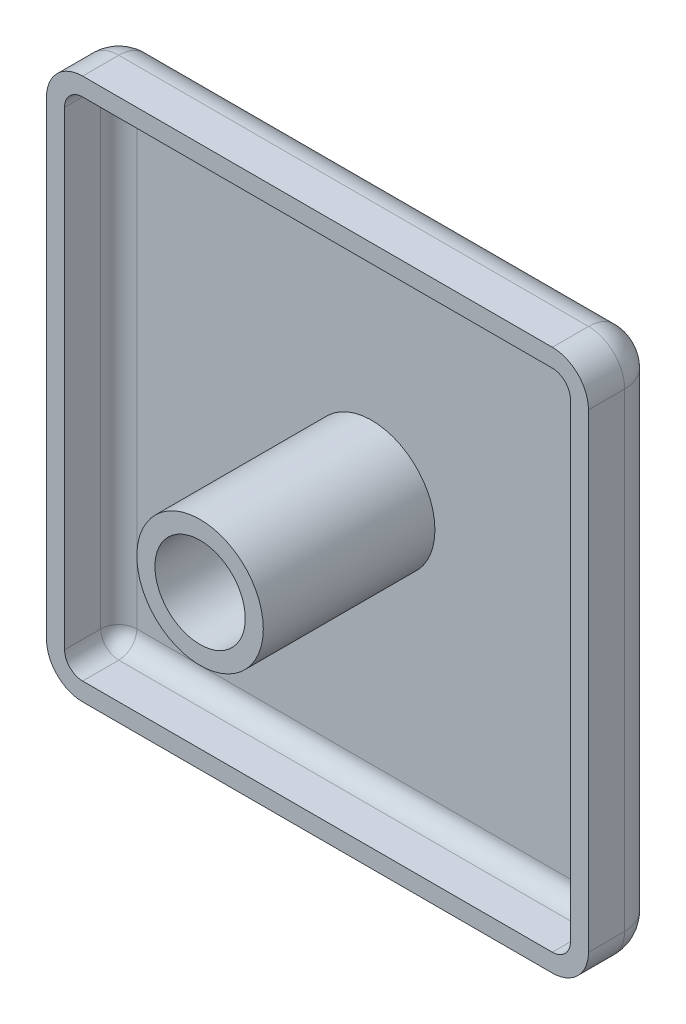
ISO-10303-21;
HEADER;
FILE_DESCRIPTION(('STEP AP214'),'2;1');
FILE_NAME('part.step','',(''),(''),'','','');
FILE_SCHEMA(('AUTOMOTIVE_DESIGN { 1 0 10303 214 1 1 1 1 }'));
ENDSEC;
DATA;
#1=APPLICATION_CONTEXT('core data for automotive mechanical design processes');
#2=APPLICATION_PROTOCOL_DEFINITION('international standard','automotive_design',2000,#1);
#3=PRODUCT_CONTEXT('',#1,'mechanical');
#4=PRODUCT('Part','Part','',(#3));
#5=PRODUCT_RELATED_PRODUCT_CATEGORY('part','',(#4));
#6=PRODUCT_DEFINITION_FORMATION('','',#4);
#7=PRODUCT_DEFINITION_CONTEXT('part definition',#1,'design');
#8=PRODUCT_DEFINITION('design','',#6,#7);
#9=PRODUCT_DEFINITION_SHAPE('','',#8);
#10=(LENGTH_UNIT() NAMED_UNIT(*) SI_UNIT(.MILLI.,.METRE.));
#11=(NAMED_UNIT(*) PLANE_ANGLE_UNIT() SI_UNIT($,.RADIAN.));
#12=(NAMED_UNIT(*) SI_UNIT($,.STERADIAN.) SOLID_ANGLE_UNIT());
#13=UNCERTAINTY_MEASURE_WITH_UNIT(LENGTH_MEASURE(1.E-05),#10,'distance_accuracy_value','');
#14=(GEOMETRIC_REPRESENTATION_CONTEXT(3) GLOBAL_UNCERTAINTY_ASSIGNED_CONTEXT((#13)) GLOBAL_UNIT_ASSIGNED_CONTEXT((#10,
#11,#12)) REPRESENTATION_CONTEXT('',''));
#15=CARTESIAN_POINT('',(0.,0.,0.));
#16=DIRECTION('',(0.,0.,1.));
#17=DIRECTION('',(1.,0.,0.));
#18=AXIS2_PLACEMENT_3D('',#15,#16,#17);
#19=CARTESIAN_POINT('',(0.,0.,-1.));
#20=DIRECTION('',(0.,0.,1.));
#21=DIRECTION('',(1.,0.,0.));
#22=AXIS2_PLACEMENT_3D('',#19,#20,#21);
#23=PLANE('',#22);
#24=DIRECTION('',(0.,1.,0.));
#25=VECTOR('',#24,1.);
#26=CARTESIAN_POINT('',(-13.,0.,-1.));
#27=LINE('',#26,#25);
#28=CARTESIAN_POINT('',(-13.,-13.,-1.));
#29=VERTEX_POINT('',#28);
#30=CARTESIAN_POINT('',(-13.,13.,-1.));
#31=VERTEX_POINT('',#30);
#32=EDGE_CURVE('E466',#29,#31,#27,.T.);
#33=ORIENTED_EDGE('',*,*,#32,.F.);
#34=DIRECTION('',(1.,0.,0.));
#35=VECTOR('',#34,1.);
#36=CARTESIAN_POINT('',(0.,-13.,-1.));
#37=LINE('',#36,#35);
#38=CARTESIAN_POINT('',(13.,-13.,-1.));
#39=VERTEX_POINT('',#38);
#40=EDGE_CURVE('E240',#39,#29,#37,.F.);
#41=ORIENTED_EDGE('',*,*,#40,.F.);
#42=DIRECTION('',(0.,1.,0.));
#43=VECTOR('',#42,1.);
#44=CARTESIAN_POINT('',(13.,0.,-1.));
#45=LINE('',#44,#43);
#46=CARTESIAN_POINT('',(13.,13.,-1.));
#47=VERTEX_POINT('',#46);
#48=EDGE_CURVE('E464',#47,#39,#45,.F.);
#49=ORIENTED_EDGE('',*,*,#48,.F.);
#50=DIRECTION('',(1.,0.,0.));
#51=VECTOR('',#50,1.);
#52=CARTESIAN_POINT('',(0.,13.,-1.));
#53=LINE('',#52,#51);
#54=EDGE_CURVE('E467',#31,#47,#53,.T.);
#55=ORIENTED_EDGE('',*,*,#54,.F.);
#56=EDGE_LOOP('',(#33,#41,#49,#55));
#57=FACE_BOUND('',#56,.T.);
#58=CARTESIAN_POINT('',(0.,0.,-1.));
#59=DIRECTION('',(0.,0.,1.));
#60=DIRECTION('',(1.,0.,0.));
#61=AXIS2_PLACEMENT_3D('',#58,#59,#60);
#62=CIRCLE('',#61,3.5);
#63=CARTESIAN_POINT('',(3.5,0.,-1.));
#64=VERTEX_POINT('',#63);
#65=EDGE_CURVE('E489',#64,#64,#62,.T.);
#66=ORIENTED_EDGE('',*,*,#65,.F.);
#67=EDGE_LOOP('',(#66));
#68=FACE_BOUND('',#67,.T.);
#69=ADVANCED_FACE('F33',(#57,#68),#23,.T.);
#70=CARTESIAN_POINT('',(-15.,15.,2.));
#71=DIRECTION('',(1.,0.,0.));
#72=DIRECTION('',(0.,1.,0.));
#73=AXIS2_PLACEMENT_3D('',#70,#71,#72);
#74=PLANE('',#73);
#75=DIRECTION('',(0.,-1.,0.));
#76=VECTOR('',#75,1.);
#77=CARTESIAN_POINT('',(-15.,15.,2.));
#78=LINE('',#77,#76);
#79=CARTESIAN_POINT('',(-15.,13.,2.));
#80=VERTEX_POINT('',#79);
#81=CARTESIAN_POINT('',(-15.,-13.,2.));
#82=VERTEX_POINT('',#81);
#83=EDGE_CURVE('E241',#80,#82,#78,.T.);
#84=ORIENTED_EDGE('',*,*,#83,.F.);
#85=DIRECTION('',(0.,0.,-1.));
#86=VECTOR('',#85,1.);
#87=CARTESIAN_POINT('',(-15.,13.,2.));
#88=LINE('',#87,#86);
#89=CARTESIAN_POINT('',(-15.,13.,0.));
#90=VERTEX_POINT('',#89);
#91=EDGE_CURVE('E258',#80,#90,#88,.T.);
#92=ORIENTED_EDGE('',*,*,#91,.T.);
#93=DIRECTION('',(0.,-1.,0.));
#94=VECTOR('',#93,1.);
#95=CARTESIAN_POINT('',(-15.,15.,0.));
#96=LINE('',#95,#94);
#97=CARTESIAN_POINT('',(-15.,-13.,0.));
#98=VERTEX_POINT('',#97);
#99=EDGE_CURVE('E256',#90,#98,#96,.T.);
#100=ORIENTED_EDGE('',*,*,#99,.T.);
#101=DIRECTION('',(0.,0.,-1.));
#102=VECTOR('',#101,1.);
#103=CARTESIAN_POINT('',(-15.,-13.,2.));
#104=LINE('',#103,#102);
#105=EDGE_CURVE('E254',#98,#82,#104,.F.);
#106=ORIENTED_EDGE('',*,*,#105,.T.);
#107=EDGE_LOOP('',(#84,#92,#100,#106));
#108=FACE_BOUND('',#107,.T.);
#109=ADVANCED_FACE('F380',(#108),#74,.F.);
#110=CARTESIAN_POINT('',(-15.,-15.,2.));
#111=DIRECTION('',(0.,1.,0.));
#112=DIRECTION('',(0.,0.,1.));
#113=AXIS2_PLACEMENT_3D('',#110,#111,#112);
#114=PLANE('',#113);
#115=DIRECTION('',(1.,0.,0.));
#116=VECTOR('',#115,1.);
#117=CARTESIAN_POINT('',(-15.,-15.,0.));
#118=LINE('',#117,#116);
#119=CARTESIAN_POINT('',(-13.,-15.,0.));
#120=VERTEX_POINT('',#119);
#121=CARTESIAN_POINT('',(13.,-15.,0.));
#122=VERTEX_POINT('',#121);
#123=EDGE_CURVE('E56',#120,#122,#118,.T.);
#124=ORIENTED_EDGE('',*,*,#123,.T.);
#125=DIRECTION('',(0.,0.,-1.));
#126=VECTOR('',#125,1.);
#127=CARTESIAN_POINT('',(13.,-15.,2.));
#128=LINE('',#127,#126);
#129=CARTESIAN_POINT('',(13.,-15.,2.));
#130=VERTEX_POINT('',#129);
#131=EDGE_CURVE('E41',#122,#130,#128,.F.);
#132=ORIENTED_EDGE('',*,*,#131,.T.);
#133=DIRECTION('',(1.,0.,0.));
#134=VECTOR('',#133,1.);
#135=CARTESIAN_POINT('',(-15.,-15.,2.));
#136=LINE('',#135,#134);
#137=CARTESIAN_POINT('',(-13.,-15.,2.));
#138=VERTEX_POINT('',#137);
#139=EDGE_CURVE('E244',#138,#130,#136,.T.);
#140=ORIENTED_EDGE('',*,*,#139,.F.);
#141=DIRECTION('',(0.,0.,-1.));
#142=VECTOR('',#141,1.);
#143=CARTESIAN_POINT('',(-13.,-15.,2.));
#144=LINE('',#143,#142);
#145=EDGE_CURVE('E290',#138,#120,#144,.T.);
#146=ORIENTED_EDGE('',*,*,#145,.T.);
#147=EDGE_LOOP('',(#124,#132,#140,#146));
#148=FACE_BOUND('',#147,.T.);
#149=ADVANCED_FACE('F386',(#148),#114,.F.);
#150=CARTESIAN_POINT('',(15.,15.,2.));
#151=DIRECTION('',(-1.,0.,0.));
#152=DIRECTION('',(0.,-1.,0.));
#153=AXIS2_PLACEMENT_3D('',#150,#151,#152);
#154=PLANE('',#153);
#155=DIRECTION('',(0.,1.,0.));
#156=VECTOR('',#155,1.);
#157=CARTESIAN_POINT('',(15.,15.,0.));
#158=LINE('',#157,#156);
#159=CARTESIAN_POINT('',(15.,-13.,0.));
#160=VERTEX_POINT('',#159);
#161=CARTESIAN_POINT('',(15.,13.,0.));
#162=VERTEX_POINT('',#161);
#163=EDGE_CURVE('E284',#160,#162,#158,.T.);
#164=ORIENTED_EDGE('',*,*,#163,.T.);
#165=DIRECTION('',(0.,0.,-1.));
#166=VECTOR('',#165,1.);
#167=CARTESIAN_POINT('',(15.,13.,2.));
#168=LINE('',#167,#166);
#169=CARTESIAN_POINT('',(15.,13.,2.));
#170=VERTEX_POINT('',#169);
#171=EDGE_CURVE('E288',#162,#170,#168,.F.);
#172=ORIENTED_EDGE('',*,*,#171,.T.);
#173=DIRECTION('',(0.,1.,0.));
#174=VECTOR('',#173,1.);
#175=CARTESIAN_POINT('',(15.,15.,2.));
#176=LINE('',#175,#174);
#177=CARTESIAN_POINT('',(15.,-13.,2.));
#178=VERTEX_POINT('',#177);
#179=EDGE_CURVE('E248',#178,#170,#176,.T.);
#180=ORIENTED_EDGE('',*,*,#179,.F.);
#181=DIRECTION('',(0.,0.,-1.));
#182=VECTOR('',#181,1.);
#183=CARTESIAN_POINT('',(15.,-13.,2.));
#184=LINE('',#183,#182);
#185=EDGE_CURVE('E286',#178,#160,#184,.T.);
#186=ORIENTED_EDGE('',*,*,#185,.T.);
#187=EDGE_LOOP('',(#164,#172,#180,#186));
#188=FACE_BOUND('',#187,.T.);
#189=ADVANCED_FACE('F350',(#188),#154,.F.);
#190=CARTESIAN_POINT('',(-15.,15.,2.));
#191=DIRECTION('',(0.,-1.,0.));
#192=DIRECTION('',(0.,0.,-1.));
#193=AXIS2_PLACEMENT_3D('',#190,#191,#192);
#194=PLANE('',#193);
#195=DIRECTION('',(-1.,0.,0.));
#196=VECTOR('',#195,1.);
#197=CARTESIAN_POINT('',(-15.,15.,0.));
#198=LINE('',#197,#196);
#199=CARTESIAN_POINT('',(13.,15.,0.));
#200=VERTEX_POINT('',#199);
#201=CARTESIAN_POINT('',(-13.,15.,0.));
#202=VERTEX_POINT('',#201);
#203=EDGE_CURVE('E263',#200,#202,#198,.T.);
#204=ORIENTED_EDGE('',*,*,#203,.T.);
#205=DIRECTION('',(0.,0.,-1.));
#206=VECTOR('',#205,1.);
#207=CARTESIAN_POINT('',(-13.,15.,2.));
#208=LINE('',#207,#206);
#209=CARTESIAN_POINT('',(-13.,15.,2.));
#210=VERTEX_POINT('',#209);
#211=EDGE_CURVE('E265',#202,#210,#208,.F.);
#212=ORIENTED_EDGE('',*,*,#211,.T.);
#213=DIRECTION('',(-1.,0.,0.));
#214=VECTOR('',#213,1.);
#215=CARTESIAN_POINT('',(-15.,15.,2.));
#216=LINE('',#215,#214);
#217=CARTESIAN_POINT('',(13.,15.,2.));
#218=VERTEX_POINT('',#217);
#219=EDGE_CURVE('E251',#218,#210,#216,.T.);
#220=ORIENTED_EDGE('',*,*,#219,.F.);
#221=DIRECTION('',(0.,0.,-1.));
#222=VECTOR('',#221,1.);
#223=CARTESIAN_POINT('',(13.,15.,2.));
#224=LINE('',#223,#222);
#225=EDGE_CURVE('E261',#218,#200,#224,.T.);
#226=ORIENTED_EDGE('',*,*,#225,.T.);
#227=EDGE_LOOP('',(#204,#212,#220,#226));
#228=FACE_BOUND('',#227,.T.);
#229=ADVANCED_FACE('F363',(#228),#194,.F.);
#230=CARTESIAN_POINT('',(0.,0.,2.));
#231=DIRECTION('',(0.,0.,1.));
#232=DIRECTION('',(1.,0.,0.));
#233=AXIS2_PLACEMENT_3D('',#230,#231,#232);
#234=PLANE('',#233);
#235=DIRECTION('',(-1.,0.,0.));
#236=VECTOR('',#235,1.);
#237=CARTESIAN_POINT('',(-15.,14.,2.));
#238=LINE('',#237,#236);
#239=CARTESIAN_POINT('',(13.,14.,2.));
#240=VERTEX_POINT('',#239);
#241=CARTESIAN_POINT('',(-13.,14.,2.));
#242=VERTEX_POINT('',#241);
#243=EDGE_CURVE('E194',#240,#242,#238,.T.);
#244=ORIENTED_EDGE('',*,*,#243,.F.);
#245=CARTESIAN_POINT('',(13.,13.,2.));
#246=DIRECTION('',(0.,0.,1.));
#247=DIRECTION('',(1.,0.,0.));
#248=AXIS2_PLACEMENT_3D('',#245,#246,#247);
#249=CIRCLE('',#248,1.);
#250=CARTESIAN_POINT('',(14.,13.,2.));
#251=VERTEX_POINT('',#250);
#252=EDGE_CURVE('E233',#251,#240,#249,.T.);
#253=ORIENTED_EDGE('',*,*,#252,.F.);
#254=DIRECTION('',(0.,1.,0.));
#255=VECTOR('',#254,1.);
#256=CARTESIAN_POINT('',(14.,15.,2.));
#257=LINE('',#256,#255);
#258=CARTESIAN_POINT('',(14.,-13.,2.));
#259=VERTEX_POINT('',#258);
#260=EDGE_CURVE('E48',#259,#251,#257,.T.);
#261=ORIENTED_EDGE('',*,*,#260,.F.);
#262=CARTESIAN_POINT('',(13.,-13.,2.));
#263=DIRECTION('',(0.,0.,1.));
#264=DIRECTION('',(1.,0.,0.));
#265=AXIS2_PLACEMENT_3D('',#262,#263,#264);
#266=CIRCLE('',#265,1.);
#267=CARTESIAN_POINT('',(13.,-14.,2.));
#268=VERTEX_POINT('',#267);
#269=EDGE_CURVE('E228',#268,#259,#266,.T.);
#270=ORIENTED_EDGE('',*,*,#269,.F.);
#271=DIRECTION('',(1.,0.,0.));
#272=VECTOR('',#271,1.);
#273=CARTESIAN_POINT('',(-15.,-14.,2.));
#274=LINE('',#273,#272);
#275=CARTESIAN_POINT('',(-13.,-14.,2.));
#276=VERTEX_POINT('',#275);
#277=EDGE_CURVE('E224',#276,#268,#274,.T.);
#278=ORIENTED_EDGE('',*,*,#277,.F.);
#279=CARTESIAN_POINT('',(-13.,-13.,2.));
#280=DIRECTION('',(0.,0.,1.));
#281=DIRECTION('',(1.,0.,0.));
#282=AXIS2_PLACEMENT_3D('',#279,#280,#281);
#283=CIRCLE('',#282,1.);
#284=CARTESIAN_POINT('',(-14.,-13.,2.));
#285=VERTEX_POINT('',#284);
#286=EDGE_CURVE('E226',#285,#276,#283,.T.);
#287=ORIENTED_EDGE('',*,*,#286,.F.);
#288=DIRECTION('',(0.,-1.,0.));
#289=VECTOR('',#288,1.);
#290=CARTESIAN_POINT('',(-14.,15.,2.));
#291=LINE('',#290,#289);
#292=CARTESIAN_POINT('',(-14.,13.,2.));
#293=VERTEX_POINT('',#292);
#294=EDGE_CURVE('E191',#293,#285,#291,.T.);
#295=ORIENTED_EDGE('',*,*,#294,.F.);
#296=CARTESIAN_POINT('',(-13.,13.,2.));
#297=DIRECTION('',(0.,0.,1.));
#298=DIRECTION('',(1.,0.,0.));
#299=AXIS2_PLACEMENT_3D('',#296,#297,#298);
#300=CIRCLE('',#299,1.);
#301=EDGE_CURVE('E236',#242,#293,#300,.T.);
#302=ORIENTED_EDGE('',*,*,#301,.F.);
#303=EDGE_LOOP('',(#244,#253,#261,#270,#278,#287,#295,#302));
#304=FACE_BOUND('',#303,.T.);
#305=ORIENTED_EDGE('',*,*,#219,.T.);
#306=CARTESIAN_POINT('',(-13.,13.,2.));
#307=DIRECTION('',(0.,0.,1.));
#308=DIRECTION('',(1.,0.,0.));
#309=AXIS2_PLACEMENT_3D('',#306,#307,#308);
#310=CIRCLE('',#309,2.);
#311=EDGE_CURVE('E273',#210,#80,#310,.T.);
#312=ORIENTED_EDGE('',*,*,#311,.T.);
#313=ORIENTED_EDGE('',*,*,#83,.T.);
#314=CARTESIAN_POINT('',(-13.,-13.,2.));
#315=DIRECTION('',(0.,0.,1.));
#316=DIRECTION('',(1.,0.,0.));
#317=AXIS2_PLACEMENT_3D('',#314,#315,#316);
#318=CIRCLE('',#317,2.);
#319=EDGE_CURVE('E267',#82,#138,#318,.T.);
#320=ORIENTED_EDGE('',*,*,#319,.T.);
#321=ORIENTED_EDGE('',*,*,#139,.T.);
#322=CARTESIAN_POINT('',(13.,-13.,2.));
#323=DIRECTION('',(0.,0.,1.));
#324=DIRECTION('',(1.,0.,0.));
#325=AXIS2_PLACEMENT_3D('',#322,#323,#324);
#326=CIRCLE('',#325,2.);
#327=EDGE_CURVE('E269',#130,#178,#326,.T.);
#328=ORIENTED_EDGE('',*,*,#327,.T.);
#329=ORIENTED_EDGE('',*,*,#179,.T.);
#330=CARTESIAN_POINT('',(13.,13.,2.));
#331=DIRECTION('',(0.,0.,1.));
#332=DIRECTION('',(1.,0.,0.));
#333=AXIS2_PLACEMENT_3D('',#330,#331,#332);
#334=CIRCLE('',#333,2.);
#335=EDGE_CURVE('E271',#170,#218,#334,.T.);
#336=ORIENTED_EDGE('',*,*,#335,.T.);
#337=EDGE_LOOP('',(#305,#312,#313,#320,#321,#328,#329,#336));
#338=FACE_BOUND('',#337,.T.);
#339=ADVANCED_FACE('F360',(#304,#338),#234,.T.);
#340=CARTESIAN_POINT('',(0.,0.,-2.));
#341=DIRECTION('',(0.,0.,1.));
#342=DIRECTION('',(1.,0.,0.));
#343=AXIS2_PLACEMENT_3D('',#340,#341,#342);
#344=PLANE('',#343);
#345=DIRECTION('',(0.,-1.,0.));
#346=VECTOR('',#345,1.);
#347=CARTESIAN_POINT('',(-13.,0.,-2.));
#348=LINE('',#347,#346);
#349=CARTESIAN_POINT('',(-13.,-13.,-2.));
#350=VERTEX_POINT('',#349);
#351=CARTESIAN_POINT('',(-13.,13.,-2.));
#352=VERTEX_POINT('',#351);
#353=EDGE_CURVE('E279',#350,#352,#348,.F.);
#354=ORIENTED_EDGE('',*,*,#353,.T.);
#355=DIRECTION('',(-1.,0.,0.));
#356=VECTOR('',#355,1.);
#357=CARTESIAN_POINT('',(0.,13.,-2.));
#358=LINE('',#357,#356);
#359=CARTESIAN_POINT('',(13.,13.,-2.));
#360=VERTEX_POINT('',#359);
#361=EDGE_CURVE('E281',#352,#360,#358,.F.);
#362=ORIENTED_EDGE('',*,*,#361,.T.);
#363=DIRECTION('',(0.,1.,0.));
#364=VECTOR('',#363,1.);
#365=CARTESIAN_POINT('',(13.,0.,-2.));
#366=LINE('',#365,#364);
#367=CARTESIAN_POINT('',(13.,-13.,-2.));
#368=VERTEX_POINT('',#367);
#369=EDGE_CURVE('E277',#360,#368,#366,.F.);
#370=ORIENTED_EDGE('',*,*,#369,.T.);
#371=DIRECTION('',(1.,0.,0.));
#372=VECTOR('',#371,1.);
#373=CARTESIAN_POINT('',(0.,-13.,-2.));
#374=LINE('',#373,#372);
#375=EDGE_CURVE('E275',#368,#350,#374,.F.);
#376=ORIENTED_EDGE('',*,*,#375,.T.);
#377=EDGE_LOOP('',(#354,#362,#370,#376));
#378=FACE_BOUND('',#377,.T.);
#379=ADVANCED_FACE('F341',(#378),#344,.F.);
#380=CARTESIAN_POINT('',(13.,-13.,2.));
#381=DIRECTION('',(0.,0.,-1.));
#382=DIRECTION('',(-1.,0.,0.));
#383=AXIS2_PLACEMENT_3D('',#380,#381,#382);
#384=CYLINDRICAL_SURFACE('',#383,2.);
#385=CARTESIAN_POINT('',(13.,-13.,0.));
#386=DIRECTION('',(0.,0.,-1.));
#387=DIRECTION('',(-1.,0.,0.));
#388=AXIS2_PLACEMENT_3D('',#385,#386,#387);
#389=CIRCLE('',#388,2.);
#390=EDGE_CURVE('E245',#160,#122,#389,.T.);
#391=ORIENTED_EDGE('',*,*,#390,.F.);
#392=ORIENTED_EDGE('',*,*,#185,.F.);
#393=ORIENTED_EDGE('',*,*,#327,.F.);
#394=ORIENTED_EDGE('',*,*,#131,.F.);
#395=EDGE_LOOP('',(#391,#392,#393,#394));
#396=FACE_BOUND('',#395,.T.);
#397=ADVANCED_FACE('F35',(#396),#384,.T.);
#398=CARTESIAN_POINT('',(13.,-13.,0.));
#399=DIRECTION('',(0.,0.,1.));
#400=DIRECTION('',(1.,0.,0.));
#401=AXIS2_PLACEMENT_3D('',#398,#399,#400);
#402=SPHERICAL_SURFACE('',#401,2.);
#403=CARTESIAN_POINT('',(13.,-13.,0.));
#404=DIRECTION('',(0.,-1.,0.));
#405=DIRECTION('',(1.,0.,0.));
#406=AXIS2_PLACEMENT_3D('',#403,#404,#405);
#407=CIRCLE('',#406,2.);
#408=EDGE_CURVE('E320',#160,#368,#407,.F.);
#409=ORIENTED_EDGE('',*,*,#408,.F.);
#410=ORIENTED_EDGE('',*,*,#390,.T.);
#411=CARTESIAN_POINT('',(13.,-13.,0.));
#412=DIRECTION('',(1.,0.,0.));
#413=DIRECTION('',(0.,0.,-1.));
#414=AXIS2_PLACEMENT_3D('',#411,#412,#413);
#415=CIRCLE('',#414,2.);
#416=EDGE_CURVE('E323',#368,#122,#415,.F.);
#417=ORIENTED_EDGE('',*,*,#416,.F.);
#418=EDGE_LOOP('',(#409,#410,#417));
#419=FACE_BOUND('',#418,.T.);
#420=ADVANCED_FACE('F330',(#419),#402,.T.);
#421=CARTESIAN_POINT('',(-13.,-13.,2.));
#422=DIRECTION('',(0.,0.,-1.));
#423=DIRECTION('',(-1.,0.,0.));
#424=AXIS2_PLACEMENT_3D('',#421,#422,#423);
#425=CYLINDRICAL_SURFACE('',#424,2.);
#426=ORIENTED_EDGE('',*,*,#319,.F.);
#427=ORIENTED_EDGE('',*,*,#105,.F.);
#428=CARTESIAN_POINT('',(-13.,-13.,0.));
#429=DIRECTION('',(0.,0.,-1.));
#430=DIRECTION('',(-1.,0.,0.));
#431=AXIS2_PLACEMENT_3D('',#428,#429,#430);
#432=CIRCLE('',#431,2.);
#433=EDGE_CURVE('E317',#120,#98,#432,.T.);
#434=ORIENTED_EDGE('',*,*,#433,.F.);
#435=ORIENTED_EDGE('',*,*,#145,.F.);
#436=EDGE_LOOP('',(#426,#427,#434,#435));
#437=FACE_BOUND('',#436,.T.);
#438=ADVANCED_FACE('F385',(#437),#425,.T.);
#439=CARTESIAN_POINT('',(-15.,-13.,0.));
#440=DIRECTION('',(1.,0.,0.));
#441=DIRECTION('',(0.,0.,-1.));
#442=AXIS2_PLACEMENT_3D('',#439,#440,#441);
#443=CYLINDRICAL_SURFACE('',#442,2.);
#444=ORIENTED_EDGE('',*,*,#416,.T.);
#445=ORIENTED_EDGE('',*,*,#123,.F.);
#446=CARTESIAN_POINT('',(-13.,-13.,0.));
#447=DIRECTION('',(-1.,0.,0.));
#448=DIRECTION('',(0.,0.,1.));
#449=AXIS2_PLACEMENT_3D('',#446,#447,#448);
#450=CIRCLE('',#449,2.);
#451=EDGE_CURVE('E314',#350,#120,#450,.T.);
#452=ORIENTED_EDGE('',*,*,#451,.F.);
#453=ORIENTED_EDGE('',*,*,#375,.F.);
#454=EDGE_LOOP('',(#444,#445,#452,#453));
#455=FACE_BOUND('',#454,.T.);
#456=ADVANCED_FACE('F336',(#455),#443,.T.);
#457=CARTESIAN_POINT('',(13.,15.,0.));
#458=DIRECTION('',(0.,1.,0.));
#459=DIRECTION('',(-1.,0.,0.));
#460=AXIS2_PLACEMENT_3D('',#457,#458,#459);
#461=CYLINDRICAL_SURFACE('',#460,2.);
#462=ORIENTED_EDGE('',*,*,#408,.T.);
#463=ORIENTED_EDGE('',*,*,#369,.F.);
#464=CARTESIAN_POINT('',(13.,13.,0.));
#465=DIRECTION('',(0.,1.,0.));
#466=DIRECTION('',(0.,0.,1.));
#467=AXIS2_PLACEMENT_3D('',#464,#465,#466);
#468=CIRCLE('',#467,2.);
#469=EDGE_CURVE('E311',#162,#360,#468,.T.);
#470=ORIENTED_EDGE('',*,*,#469,.F.);
#471=ORIENTED_EDGE('',*,*,#163,.F.);
#472=EDGE_LOOP('',(#462,#463,#470,#471));
#473=FACE_BOUND('',#472,.T.);
#474=ADVANCED_FACE('F347',(#473),#461,.T.);
#475=CARTESIAN_POINT('',(13.,13.,2.));
#476=DIRECTION('',(0.,0.,-1.));
#477=DIRECTION('',(-1.,0.,0.));
#478=AXIS2_PLACEMENT_3D('',#475,#476,#477);
#479=CYLINDRICAL_SURFACE('',#478,2.);
#480=ORIENTED_EDGE('',*,*,#335,.F.);
#481=ORIENTED_EDGE('',*,*,#171,.F.);
#482=CARTESIAN_POINT('',(13.,13.,0.));
#483=DIRECTION('',(0.,0.,-1.));
#484=DIRECTION('',(-1.,0.,0.));
#485=AXIS2_PLACEMENT_3D('',#482,#483,#484);
#486=CIRCLE('',#485,2.);
#487=EDGE_CURVE('E308',#200,#162,#486,.T.);
#488=ORIENTED_EDGE('',*,*,#487,.F.);
#489=ORIENTED_EDGE('',*,*,#225,.F.);
#490=EDGE_LOOP('',(#480,#481,#488,#489));
#491=FACE_BOUND('',#490,.T.);
#492=ADVANCED_FACE('F355',(#491),#479,.T.);
#493=CARTESIAN_POINT('',(-13.,-13.,0.));
#494=DIRECTION('',(0.,0.,1.));
#495=DIRECTION('',(1.,0.,0.));
#496=AXIS2_PLACEMENT_3D('',#493,#494,#495);
#497=SPHERICAL_SURFACE('',#496,2.);
#498=ORIENTED_EDGE('',*,*,#451,.T.);
#499=ORIENTED_EDGE('',*,*,#433,.T.);
#500=CARTESIAN_POINT('',(-13.,-13.,0.));
#501=DIRECTION('',(0.,-1.,0.));
#502=DIRECTION('',(0.,0.,-1.));
#503=AXIS2_PLACEMENT_3D('',#500,#501,#502);
#504=CIRCLE('',#503,2.);
#505=EDGE_CURVE('E305',#350,#98,#504,.F.);
#506=ORIENTED_EDGE('',*,*,#505,.F.);
#507=EDGE_LOOP('',(#498,#499,#506));
#508=FACE_BOUND('',#507,.T.);
#509=ADVANCED_FACE('F549',(#508),#497,.T.);
#510=CARTESIAN_POINT('',(13.,13.,0.));
#511=DIRECTION('',(0.,0.,1.));
#512=DIRECTION('',(1.,0.,0.));
#513=AXIS2_PLACEMENT_3D('',#510,#511,#512);
#514=SPHERICAL_SURFACE('',#513,2.);
#515=ORIENTED_EDGE('',*,*,#487,.T.);
#516=ORIENTED_EDGE('',*,*,#469,.T.);
#517=CARTESIAN_POINT('',(13.,13.,0.));
#518=DIRECTION('',(1.,0.,0.));
#519=DIRECTION('',(0.,1.,0.));
#520=AXIS2_PLACEMENT_3D('',#517,#518,#519);
#521=CIRCLE('',#520,2.);
#522=EDGE_CURVE('E303',#200,#360,#521,.F.);
#523=ORIENTED_EDGE('',*,*,#522,.F.);
#524=EDGE_LOOP('',(#515,#516,#523));
#525=FACE_BOUND('',#524,.T.);
#526=ADVANCED_FACE('F546',(#525),#514,.T.);
#527=CARTESIAN_POINT('',(-13.,15.,0.));
#528=DIRECTION('',(0.,-1.,0.));
#529=DIRECTION('',(1.,0.,0.));
#530=AXIS2_PLACEMENT_3D('',#527,#528,#529);
#531=CYLINDRICAL_SURFACE('',#530,2.);
#532=ORIENTED_EDGE('',*,*,#505,.T.);
#533=ORIENTED_EDGE('',*,*,#99,.F.);
#534=CARTESIAN_POINT('',(-13.,13.,0.));
#535=DIRECTION('',(0.,1.,0.));
#536=DIRECTION('',(0.,0.,1.));
#537=AXIS2_PLACEMENT_3D('',#534,#535,#536);
#538=CIRCLE('',#537,2.);
#539=EDGE_CURVE('E300',#352,#90,#538,.T.);
#540=ORIENTED_EDGE('',*,*,#539,.F.);
#541=ORIENTED_EDGE('',*,*,#353,.F.);
#542=EDGE_LOOP('',(#532,#533,#540,#541));
#543=FACE_BOUND('',#542,.T.);
#544=ADVANCED_FACE('F376',(#543),#531,.T.);
#545=CARTESIAN_POINT('',(-15.,13.,0.));
#546=DIRECTION('',(-1.,0.,0.));
#547=DIRECTION('',(0.,0.,1.));
#548=AXIS2_PLACEMENT_3D('',#545,#546,#547);
#549=CYLINDRICAL_SURFACE('',#548,2.);
#550=ORIENTED_EDGE('',*,*,#522,.T.);
#551=ORIENTED_EDGE('',*,*,#361,.F.);
#552=CARTESIAN_POINT('',(-13.,13.,0.));
#553=DIRECTION('',(-1.,0.,0.));
#554=DIRECTION('',(0.,0.,1.));
#555=AXIS2_PLACEMENT_3D('',#552,#553,#554);
#556=CIRCLE('',#555,2.);
#557=EDGE_CURVE('E296',#202,#352,#556,.T.);
#558=ORIENTED_EDGE('',*,*,#557,.F.);
#559=ORIENTED_EDGE('',*,*,#203,.F.);
#560=EDGE_LOOP('',(#550,#551,#558,#559));
#561=FACE_BOUND('',#560,.T.);
#562=ADVANCED_FACE('F540',(#561),#549,.T.);
#563=CARTESIAN_POINT('',(-13.,13.,0.));
#564=DIRECTION('',(0.,0.,1.));
#565=DIRECTION('',(1.,0.,0.));
#566=AXIS2_PLACEMENT_3D('',#563,#564,#565);
#567=SPHERICAL_SURFACE('',#566,2.);
#568=ORIENTED_EDGE('',*,*,#557,.T.);
#569=ORIENTED_EDGE('',*,*,#539,.T.);
#570=CARTESIAN_POINT('',(-13.,13.,0.));
#571=DIRECTION('',(0.,0.,-1.));
#572=DIRECTION('',(-1.,0.,0.));
#573=AXIS2_PLACEMENT_3D('',#570,#571,#572);
#574=CIRCLE('',#573,2.);
#575=EDGE_CURVE('E294',#202,#90,#574,.F.);
#576=ORIENTED_EDGE('',*,*,#575,.F.);
#577=EDGE_LOOP('',(#568,#569,#576));
#578=FACE_BOUND('',#577,.T.);
#579=ADVANCED_FACE('F372',(#578),#567,.T.);
#580=CARTESIAN_POINT('',(-13.,13.,2.));
#581=DIRECTION('',(0.,0.,-1.));
#582=DIRECTION('',(-1.,0.,0.));
#583=AXIS2_PLACEMENT_3D('',#580,#581,#582);
#584=CYLINDRICAL_SURFACE('',#583,2.);
#585=ORIENTED_EDGE('',*,*,#311,.F.);
#586=ORIENTED_EDGE('',*,*,#211,.F.);
#587=ORIENTED_EDGE('',*,*,#575,.T.);
#588=ORIENTED_EDGE('',*,*,#91,.F.);
#589=EDGE_LOOP('',(#585,#586,#587,#588));
#590=FACE_BOUND('',#589,.T.);
#591=ADVANCED_FACE('F369',(#590),#584,.T.);
#592=CARTESIAN_POINT('',(-14.,15.,2.));
#593=DIRECTION('',(1.,0.,0.));
#594=DIRECTION('',(0.,1.,0.));
#595=AXIS2_PLACEMENT_3D('',#592,#593,#594);
#596=PLANE('',#595);
#597=ORIENTED_EDGE('',*,*,#294,.T.);
#598=DIRECTION('',(0.,0.,1.));
#599=VECTOR('',#598,1.);
#600=CARTESIAN_POINT('',(-14.,-13.,2.));
#601=LINE('',#600,#599);
#602=CARTESIAN_POINT('',(-14.,-13.,0.));
#603=VERTEX_POINT('',#602);
#604=EDGE_CURVE('E185',#603,#285,#601,.T.);
#605=ORIENTED_EDGE('',*,*,#604,.F.);
#606=DIRECTION('',(0.,1.,0.));
#607=VECTOR('',#606,1.);
#608=CARTESIAN_POINT('',(-14.,15.,0.));
#609=LINE('',#608,#607);
#610=CARTESIAN_POINT('',(-14.,13.,0.));
#611=VERTEX_POINT('',#610);
#612=EDGE_CURVE('E173',#611,#603,#609,.F.);
#613=ORIENTED_EDGE('',*,*,#612,.F.);
#614=DIRECTION('',(0.,0.,1.));
#615=VECTOR('',#614,1.);
#616=CARTESIAN_POINT('',(-14.,13.,2.));
#617=LINE('',#616,#615);
#618=EDGE_CURVE('E184',#293,#611,#617,.F.);
#619=ORIENTED_EDGE('',*,*,#618,.F.);
#620=EDGE_LOOP('',(#597,#605,#613,#619));
#621=FACE_BOUND('',#620,.T.);
#622=ADVANCED_FACE('F189',(#621),#596,.T.);
#623=CARTESIAN_POINT('',(-15.,-14.,2.));
#624=DIRECTION('',(0.,1.,0.));
#625=DIRECTION('',(0.,0.,1.));
#626=AXIS2_PLACEMENT_3D('',#623,#624,#625);
#627=PLANE('',#626);
#628=DIRECTION('',(1.,0.,0.));
#629=VECTOR('',#628,1.);
#630=CARTESIAN_POINT('',(-15.,-14.,0.));
#631=LINE('',#630,#629);
#632=CARTESIAN_POINT('',(-13.,-14.,0.));
#633=VERTEX_POINT('',#632);
#634=CARTESIAN_POINT('',(13.,-14.,0.));
#635=VERTEX_POINT('',#634);
#636=EDGE_CURVE('E485',#633,#635,#631,.T.);
#637=ORIENTED_EDGE('',*,*,#636,.F.);
#638=DIRECTION('',(0.,0.,1.));
#639=VECTOR('',#638,1.);
#640=CARTESIAN_POINT('',(-13.,-14.,2.));
#641=LINE('',#640,#639);
#642=EDGE_CURVE('E200',#276,#633,#641,.F.);
#643=ORIENTED_EDGE('',*,*,#642,.F.);
#644=ORIENTED_EDGE('',*,*,#277,.T.);
#645=DIRECTION('',(0.,0.,1.));
#646=VECTOR('',#645,1.);
#647=CARTESIAN_POINT('',(13.,-14.,2.));
#648=LINE('',#647,#646);
#649=EDGE_CURVE('E297',#635,#268,#648,.T.);
#650=ORIENTED_EDGE('',*,*,#649,.F.);
#651=EDGE_LOOP('',(#637,#643,#644,#650));
#652=FACE_BOUND('',#651,.T.);
#653=ADVANCED_FACE('F430',(#652),#627,.T.);
#654=CARTESIAN_POINT('',(14.,15.,2.));
#655=DIRECTION('',(-1.,0.,0.));
#656=DIRECTION('',(0.,-1.,0.));
#657=AXIS2_PLACEMENT_3D('',#654,#655,#656);
#658=PLANE('',#657);
#659=DIRECTION('',(0.,-1.,0.));
#660=VECTOR('',#659,1.);
#661=CARTESIAN_POINT('',(14.,15.,0.));
#662=LINE('',#661,#660);
#663=CARTESIAN_POINT('',(14.,-13.,0.));
#664=VERTEX_POINT('',#663);
#665=CARTESIAN_POINT('',(14.,13.,0.));
#666=VERTEX_POINT('',#665);
#667=EDGE_CURVE('E470',#664,#666,#662,.F.);
#668=ORIENTED_EDGE('',*,*,#667,.F.);
#669=DIRECTION('',(0.,0.,1.));
#670=VECTOR('',#669,1.);
#671=CARTESIAN_POINT('',(14.,-13.,2.));
#672=LINE('',#671,#670);
#673=EDGE_CURVE('E479',#259,#664,#672,.F.);
#674=ORIENTED_EDGE('',*,*,#673,.F.);
#675=ORIENTED_EDGE('',*,*,#260,.T.);
#676=DIRECTION('',(0.,0.,1.));
#677=VECTOR('',#676,1.);
#678=CARTESIAN_POINT('',(14.,13.,2.));
#679=LINE('',#678,#677);
#680=EDGE_CURVE('E477',#666,#251,#679,.T.);
#681=ORIENTED_EDGE('',*,*,#680,.F.);
#682=EDGE_LOOP('',(#668,#674,#675,#681));
#683=FACE_BOUND('',#682,.T.);
#684=ADVANCED_FACE('F433',(#683),#658,.T.);
#685=CARTESIAN_POINT('',(-15.,14.,2.));
#686=DIRECTION('',(0.,-1.,0.));
#687=DIRECTION('',(0.,0.,-1.));
#688=AXIS2_PLACEMENT_3D('',#685,#686,#687);
#689=PLANE('',#688);
#690=DIRECTION('',(1.,0.,0.));
#691=VECTOR('',#690,1.);
#692=CARTESIAN_POINT('',(-15.,14.,0.));
#693=LINE('',#692,#691);
#694=CARTESIAN_POINT('',(13.,14.,0.));
#695=VERTEX_POINT('',#694);
#696=CARTESIAN_POINT('',(-13.,14.,0.));
#697=VERTEX_POINT('',#696);
#698=EDGE_CURVE('E448',#695,#697,#693,.F.);
#699=ORIENTED_EDGE('',*,*,#698,.F.);
#700=DIRECTION('',(0.,0.,-1.));
#701=VECTOR('',#700,1.);
#702=CARTESIAN_POINT('',(13.,14.,2.));
#703=LINE('',#702,#701);
#704=EDGE_CURVE('E449',#240,#695,#703,.T.);
#705=ORIENTED_EDGE('',*,*,#704,.F.);
#706=ORIENTED_EDGE('',*,*,#243,.T.);
#707=DIRECTION('',(0.,0.,-1.));
#708=VECTOR('',#707,1.);
#709=CARTESIAN_POINT('',(-13.,14.,2.));
#710=LINE('',#709,#708);
#711=EDGE_CURVE('E229',#697,#242,#710,.F.);
#712=ORIENTED_EDGE('',*,*,#711,.F.);
#713=EDGE_LOOP('',(#699,#705,#706,#712));
#714=FACE_BOUND('',#713,.T.);
#715=ADVANCED_FACE('F436',(#714),#689,.T.);
#716=CARTESIAN_POINT('',(13.,-13.,2.));
#717=DIRECTION('',(0.,0.,-1.));
#718=DIRECTION('',(-1.,0.,0.));
#719=AXIS2_PLACEMENT_3D('',#716,#717,#718);
#720=CYLINDRICAL_SURFACE('',#719,1.);
#721=CARTESIAN_POINT('',(13.,-13.,0.));
#722=DIRECTION('',(0.,0.,1.));
#723=DIRECTION('',(1.,0.,0.));
#724=AXIS2_PLACEMENT_3D('',#721,#722,#723);
#725=CIRCLE('',#724,1.);
#726=EDGE_CURVE('E225',#664,#635,#725,.F.);
#727=ORIENTED_EDGE('',*,*,#726,.T.);
#728=ORIENTED_EDGE('',*,*,#649,.T.);
#729=ORIENTED_EDGE('',*,*,#269,.T.);
#730=ORIENTED_EDGE('',*,*,#673,.T.);
#731=EDGE_LOOP('',(#727,#728,#729,#730));
#732=FACE_BOUND('',#731,.T.);
#733=ADVANCED_FACE('F438',(#732),#720,.F.);
#734=CARTESIAN_POINT('',(13.,-13.,0.));
#735=DIRECTION('',(0.,0.,1.));
#736=DIRECTION('',(1.,0.,0.));
#737=AXIS2_PLACEMENT_3D('',#734,#735,#736);
#738=SPHERICAL_SURFACE('',#737,1.);
#739=CARTESIAN_POINT('',(13.,-13.,0.));
#740=DIRECTION('',(0.,1.,0.));
#741=DIRECTION('',(-1.,0.,0.));
#742=AXIS2_PLACEMENT_3D('',#739,#740,#741);
#743=CIRCLE('',#742,1.);
#744=EDGE_CURVE('E205',#664,#39,#743,.T.);
#745=ORIENTED_EDGE('',*,*,#744,.T.);
#746=CARTESIAN_POINT('',(13.,-13.,0.));
#747=DIRECTION('',(1.,0.,0.));
#748=DIRECTION('',(0.,0.,-1.));
#749=AXIS2_PLACEMENT_3D('',#746,#747,#748);
#750=CIRCLE('',#749,1.);
#751=EDGE_CURVE('E472',#39,#635,#750,.F.);
#752=ORIENTED_EDGE('',*,*,#751,.T.);
#753=ORIENTED_EDGE('',*,*,#726,.F.);
#754=EDGE_LOOP('',(#745,#752,#753));
#755=FACE_BOUND('',#754,.T.);
#756=ADVANCED_FACE('F443',(#755),#738,.F.);
#757=CARTESIAN_POINT('',(-13.,-13.,2.));
#758=DIRECTION('',(0.,0.,-1.));
#759=DIRECTION('',(-1.,0.,0.));
#760=AXIS2_PLACEMENT_3D('',#757,#758,#759);
#761=CYLINDRICAL_SURFACE('',#760,1.);
#762=ORIENTED_EDGE('',*,*,#286,.T.);
#763=ORIENTED_EDGE('',*,*,#642,.T.);
#764=CARTESIAN_POINT('',(-13.,-13.,0.));
#765=DIRECTION('',(0.,0.,1.));
#766=DIRECTION('',(1.,0.,0.));
#767=AXIS2_PLACEMENT_3D('',#764,#765,#766);
#768=CIRCLE('',#767,1.);
#769=EDGE_CURVE('E197',#633,#603,#768,.F.);
#770=ORIENTED_EDGE('',*,*,#769,.T.);
#771=ORIENTED_EDGE('',*,*,#604,.T.);
#772=EDGE_LOOP('',(#762,#763,#770,#771));
#773=FACE_BOUND('',#772,.T.);
#774=ADVANCED_FACE('F198',(#773),#761,.F.);
#775=CARTESIAN_POINT('',(-15.,-13.,0.));
#776=DIRECTION('',(1.,0.,0.));
#777=DIRECTION('',(0.,0.,-1.));
#778=AXIS2_PLACEMENT_3D('',#775,#776,#777);
#779=CYLINDRICAL_SURFACE('',#778,1.);
#780=ORIENTED_EDGE('',*,*,#751,.F.);
#781=ORIENTED_EDGE('',*,*,#40,.T.);
#782=CARTESIAN_POINT('',(-13.,-13.,0.));
#783=DIRECTION('',(-1.,0.,0.));
#784=DIRECTION('',(0.,-1.,0.));
#785=AXIS2_PLACEMENT_3D('',#782,#783,#784);
#786=CIRCLE('',#785,1.);
#787=EDGE_CURVE('E206',#29,#633,#786,.T.);
#788=ORIENTED_EDGE('',*,*,#787,.T.);
#789=ORIENTED_EDGE('',*,*,#636,.T.);
#790=EDGE_LOOP('',(#780,#781,#788,#789));
#791=FACE_BOUND('',#790,.T.);
#792=ADVANCED_FACE('F508',(#791),#779,.F.);
#793=CARTESIAN_POINT('',(13.,15.,0.));
#794=DIRECTION('',(0.,1.,0.));
#795=DIRECTION('',(-1.,0.,0.));
#796=AXIS2_PLACEMENT_3D('',#793,#794,#795);
#797=CYLINDRICAL_SURFACE('',#796,1.);
#798=ORIENTED_EDGE('',*,*,#744,.F.);
#799=ORIENTED_EDGE('',*,*,#667,.T.);
#800=CARTESIAN_POINT('',(13.,13.,0.));
#801=DIRECTION('',(0.,-1.,0.));
#802=DIRECTION('',(0.,0.,-1.));
#803=AXIS2_PLACEMENT_3D('',#800,#801,#802);
#804=CIRCLE('',#803,1.);
#805=EDGE_CURVE('E213',#666,#47,#804,.F.);
#806=ORIENTED_EDGE('',*,*,#805,.T.);
#807=ORIENTED_EDGE('',*,*,#48,.T.);
#808=EDGE_LOOP('',(#798,#799,#806,#807));
#809=FACE_BOUND('',#808,.T.);
#810=ADVANCED_FACE('F651',(#809),#797,.F.);
#811=CARTESIAN_POINT('',(13.,13.,2.));
#812=DIRECTION('',(0.,0.,-1.));
#813=DIRECTION('',(-1.,0.,0.));
#814=AXIS2_PLACEMENT_3D('',#811,#812,#813);
#815=CYLINDRICAL_SURFACE('',#814,1.);
#816=ORIENTED_EDGE('',*,*,#252,.T.);
#817=ORIENTED_EDGE('',*,*,#704,.T.);
#818=CARTESIAN_POINT('',(13.,13.,0.));
#819=DIRECTION('',(0.,0.,1.));
#820=DIRECTION('',(1.,0.,0.));
#821=AXIS2_PLACEMENT_3D('',#818,#819,#820);
#822=CIRCLE('',#821,1.);
#823=EDGE_CURVE('E209',#695,#666,#822,.F.);
#824=ORIENTED_EDGE('',*,*,#823,.T.);
#825=ORIENTED_EDGE('',*,*,#680,.T.);
#826=EDGE_LOOP('',(#816,#817,#824,#825));
#827=FACE_BOUND('',#826,.T.);
#828=ADVANCED_FACE('F660',(#827),#815,.F.);
#829=CARTESIAN_POINT('',(-13.,-13.,0.));
#830=DIRECTION('',(0.,0.,1.));
#831=DIRECTION('',(1.,0.,0.));
#832=AXIS2_PLACEMENT_3D('',#829,#830,#831);
#833=SPHERICAL_SURFACE('',#832,1.);
#834=ORIENTED_EDGE('',*,*,#787,.F.);
#835=CARTESIAN_POINT('',(-13.,-13.,0.));
#836=DIRECTION('',(0.,-1.,0.));
#837=DIRECTION('',(1.,0.,0.));
#838=AXIS2_PLACEMENT_3D('',#835,#836,#837);
#839=CIRCLE('',#838,1.);
#840=EDGE_CURVE('E177',#29,#603,#839,.F.);
#841=ORIENTED_EDGE('',*,*,#840,.T.);
#842=ORIENTED_EDGE('',*,*,#769,.F.);
#843=EDGE_LOOP('',(#834,#841,#842));
#844=FACE_BOUND('',#843,.T.);
#845=ADVANCED_FACE('F208',(#844),#833,.F.);
#846=CARTESIAN_POINT('',(13.,13.,0.));
#847=DIRECTION('',(0.,0.,1.));
#848=DIRECTION('',(1.,0.,0.));
#849=AXIS2_PLACEMENT_3D('',#846,#847,#848);
#850=SPHERICAL_SURFACE('',#849,1.);
#851=ORIENTED_EDGE('',*,*,#823,.F.);
#852=CARTESIAN_POINT('',(13.,13.,0.));
#853=DIRECTION('',(-1.,0.,0.));
#854=DIRECTION('',(0.,0.,1.));
#855=AXIS2_PLACEMENT_3D('',#852,#853,#854);
#856=CIRCLE('',#855,1.);
#857=EDGE_CURVE('E210',#695,#47,#856,.T.);
#858=ORIENTED_EDGE('',*,*,#857,.T.);
#859=ORIENTED_EDGE('',*,*,#805,.F.);
#860=EDGE_LOOP('',(#851,#858,#859));
#861=FACE_BOUND('',#860,.T.);
#862=ADVANCED_FACE('F522',(#861),#850,.F.);
#863=CARTESIAN_POINT('',(-13.,15.,0.));
#864=DIRECTION('',(0.,-1.,0.));
#865=DIRECTION('',(1.,0.,0.));
#866=AXIS2_PLACEMENT_3D('',#863,#864,#865);
#867=CYLINDRICAL_SURFACE('',#866,1.);
#868=ORIENTED_EDGE('',*,*,#840,.F.);
#869=ORIENTED_EDGE('',*,*,#32,.T.);
#870=CARTESIAN_POINT('',(-13.,13.,0.));
#871=DIRECTION('',(0.,1.,0.));
#872=DIRECTION('',(-1.,0.,0.));
#873=AXIS2_PLACEMENT_3D('',#870,#871,#872);
#874=CIRCLE('',#873,1.);
#875=EDGE_CURVE('E180',#31,#611,#874,.T.);
#876=ORIENTED_EDGE('',*,*,#875,.T.);
#877=ORIENTED_EDGE('',*,*,#612,.T.);
#878=EDGE_LOOP('',(#868,#869,#876,#877));
#879=FACE_BOUND('',#878,.T.);
#880=ADVANCED_FACE('F175',(#879),#867,.F.);
#881=CARTESIAN_POINT('',(-15.,13.,0.));
#882=DIRECTION('',(-1.,0.,0.));
#883=DIRECTION('',(0.,0.,1.));
#884=AXIS2_PLACEMENT_3D('',#881,#882,#883);
#885=CYLINDRICAL_SURFACE('',#884,1.);
#886=ORIENTED_EDGE('',*,*,#857,.F.);
#887=ORIENTED_EDGE('',*,*,#698,.T.);
#888=CARTESIAN_POINT('',(-13.,13.,0.));
#889=DIRECTION('',(1.,0.,0.));
#890=DIRECTION('',(0.,1.,0.));
#891=AXIS2_PLACEMENT_3D('',#888,#889,#890);
#892=CIRCLE('',#891,1.);
#893=EDGE_CURVE('E218',#697,#31,#892,.F.);
#894=ORIENTED_EDGE('',*,*,#893,.T.);
#895=ORIENTED_EDGE('',*,*,#54,.T.);
#896=EDGE_LOOP('',(#886,#887,#894,#895));
#897=FACE_BOUND('',#896,.T.);
#898=ADVANCED_FACE('F514',(#897),#885,.F.);
#899=CARTESIAN_POINT('',(-13.,13.,0.));
#900=DIRECTION('',(0.,0.,1.));
#901=DIRECTION('',(1.,0.,0.));
#902=AXIS2_PLACEMENT_3D('',#899,#900,#901);
#903=SPHERICAL_SURFACE('',#902,1.);
#904=ORIENTED_EDGE('',*,*,#893,.F.);
#905=CARTESIAN_POINT('',(-13.,13.,0.));
#906=DIRECTION('',(0.,0.,-1.));
#907=DIRECTION('',(-1.,0.,0.));
#908=AXIS2_PLACEMENT_3D('',#905,#906,#907);
#909=CIRCLE('',#908,1.);
#910=EDGE_CURVE('E220',#697,#611,#909,.F.);
#911=ORIENTED_EDGE('',*,*,#910,.T.);
#912=ORIENTED_EDGE('',*,*,#875,.F.);
#913=EDGE_LOOP('',(#904,#911,#912));
#914=FACE_BOUND('',#913,.T.);
#915=ADVANCED_FACE('F513',(#914),#903,.F.);
#916=CARTESIAN_POINT('',(-13.,13.,2.));
#917=DIRECTION('',(0.,0.,-1.));
#918=DIRECTION('',(-1.,0.,0.));
#919=AXIS2_PLACEMENT_3D('',#916,#917,#918);
#920=CYLINDRICAL_SURFACE('',#919,1.);
#921=ORIENTED_EDGE('',*,*,#301,.T.);
#922=ORIENTED_EDGE('',*,*,#618,.T.);
#923=ORIENTED_EDGE('',*,*,#910,.F.);
#924=ORIENTED_EDGE('',*,*,#711,.T.);
#925=EDGE_LOOP('',(#921,#922,#923,#924));
#926=FACE_BOUND('',#925,.T.);
#927=ADVANCED_FACE('F425',(#926),#920,.F.);
#928=CARTESIAN_POINT('',(0.,0.,8.5));
#929=DIRECTION('',(0.,0.,1.));
#930=DIRECTION('',(1.,0.,0.));
#931=AXIS2_PLACEMENT_3D('',#928,#929,#930);
#932=PLANE('',#931);
#933=CARTESIAN_POINT('',(0.,0.,8.5));
#934=DIRECTION('',(0.,0.,1.));
#935=DIRECTION('',(1.,0.,0.));
#936=AXIS2_PLACEMENT_3D('',#933,#934,#935);
#937=CIRCLE('',#936,3.5);
#938=CARTESIAN_POINT('',(3.5,0.,8.5));
#939=VERTEX_POINT('',#938);
#940=EDGE_CURVE('E222',#939,#939,#937,.T.);
#941=ORIENTED_EDGE('',*,*,#940,.T.);
#942=EDGE_LOOP('',(#941));
#943=FACE_BOUND('',#942,.T.);
#944=CARTESIAN_POINT('',(0.,0.,8.5));
#945=DIRECTION('',(0.,0.,1.));
#946=DIRECTION('',(1.,0.,0.));
#947=AXIS2_PLACEMENT_3D('',#944,#945,#946);
#948=CIRCLE('',#947,2.5);
#949=CARTESIAN_POINT('',(2.5,0.,8.5));
#950=VERTEX_POINT('',#949);
#951=EDGE_CURVE('E492',#950,#950,#948,.T.);
#952=ORIENTED_EDGE('',*,*,#951,.F.);
#953=EDGE_LOOP('',(#952));
#954=FACE_BOUND('',#953,.T.);
#955=ADVANCED_FACE('F419',(#943,#954),#932,.T.);
#956=CARTESIAN_POINT('',(0.,0.,8.5));
#957=DIRECTION('',(0.,0.,-1.));
#958=DIRECTION('',(-1.,0.,0.));
#959=AXIS2_PLACEMENT_3D('',#956,#957,#958);
#960=CYLINDRICAL_SURFACE('',#959,3.5);
#961=ORIENTED_EDGE('',*,*,#940,.F.);
#962=EDGE_LOOP('',(#961));
#963=FACE_BOUND('',#962,.T.);
#964=ORIENTED_EDGE('',*,*,#65,.T.);
#965=EDGE_LOOP('',(#964));
#966=FACE_BOUND('',#965,.T.);
#967=ADVANCED_FACE('F411',(#963,#966),#960,.T.);
#968=CARTESIAN_POINT('',(0.,0.,8.5));
#969=DIRECTION('',(0.,0.,-1.));
#970=DIRECTION('',(-1.,0.,0.));
#971=AXIS2_PLACEMENT_3D('',#968,#969,#970);
#972=CYLINDRICAL_SURFACE('',#971,2.5);
#973=ORIENTED_EDGE('',*,*,#951,.T.);
#974=EDGE_LOOP('',(#973));
#975=FACE_BOUND('',#974,.T.);
#976=CARTESIAN_POINT('',(0.,0.,-1.));
#977=DIRECTION('',(0.,0.,1.));
#978=DIRECTION('',(1.,0.,0.));
#979=AXIS2_PLACEMENT_3D('',#976,#977,#978);
#980=CIRCLE('',#979,2.5);
#981=CARTESIAN_POINT('',(2.5,0.,-1.));
#982=VERTEX_POINT('',#981);
#983=EDGE_CURVE('E11',#982,#982,#980,.F.);
#984=ORIENTED_EDGE('',*,*,#983,.T.);
#985=EDGE_LOOP('',(#984));
#986=FACE_BOUND('',#985,.T.);
#987=ADVANCED_FACE('F406',(#975,#986),#972,.F.);
#988=ORIENTED_EDGE('',*,*,#983,.F.);
#989=EDGE_LOOP('',(#988));
#990=FACE_BOUND('',#989,.T.);
#991=ADVANCED_FACE('F397',(#990),#23,.T.);
#992=CLOSED_SHELL('',(#69,#109,#149,#189,#229,#339,#379,#397,#420,#438,#456,#474,#492,#509,#526,
#544,#562,#579,#591,#622,#653,#684,#715,#733,#756,#774,#792,#810,#828,#845,#862,#880,#898,#915,
#927,#955,#967,#987,#991));
#993=MANIFOLD_SOLID_BREP('B2',#992);
#994=ADVANCED_BREP_SHAPE_REPRESENTATION('',(#18,#993),#14);
#995=SHAPE_DEFINITION_REPRESENTATION(#9,#994);
ENDSEC;
END-ISO-10303-21;
